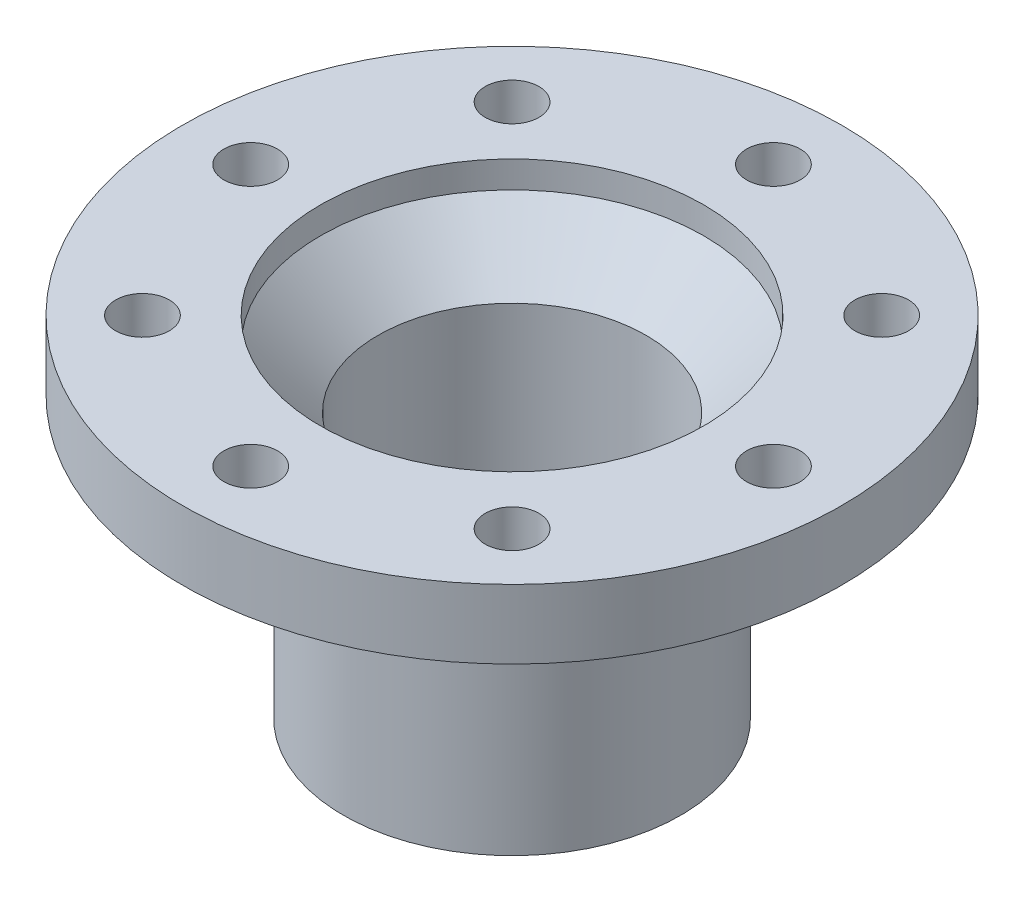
ISO-10303-21;
HEADER;
FILE_DESCRIPTION(('STEP AP214'),'2;1');
FILE_NAME('part.step','',(''),(''),'','','');
FILE_SCHEMA(('AUTOMOTIVE_DESIGN { 1 0 10303 214 1 1 1 1 }'));
ENDSEC;
DATA;
#1=APPLICATION_CONTEXT('core data for automotive mechanical design processes');
#2=APPLICATION_PROTOCOL_DEFINITION('international standard','automotive_design',2000,#1);
#3=PRODUCT_CONTEXT('',#1,'mechanical');
#4=PRODUCT('Part','Part','',(#3));
#5=PRODUCT_RELATED_PRODUCT_CATEGORY('part','',(#4));
#6=PRODUCT_DEFINITION_FORMATION('','',#4);
#7=PRODUCT_DEFINITION_CONTEXT('part definition',#1,'design');
#8=PRODUCT_DEFINITION('design','',#6,#7);
#9=PRODUCT_DEFINITION_SHAPE('','',#8);
#10=(LENGTH_UNIT() NAMED_UNIT(*) SI_UNIT(.MILLI.,.METRE.));
#11=(NAMED_UNIT(*) PLANE_ANGLE_UNIT() SI_UNIT($,.RADIAN.));
#12=(NAMED_UNIT(*) SI_UNIT($,.STERADIAN.) SOLID_ANGLE_UNIT());
#13=UNCERTAINTY_MEASURE_WITH_UNIT(LENGTH_MEASURE(1.E-05),#10,'distance_accuracy_value','');
#14=(GEOMETRIC_REPRESENTATION_CONTEXT(3) GLOBAL_UNCERTAINTY_ASSIGNED_CONTEXT((#13)) GLOBAL_UNIT_ASSIGNED_CONTEXT((#10,
#11,#12)) REPRESENTATION_CONTEXT('',''));
#15=CARTESIAN_POINT('',(0.,0.,0.));
#16=DIRECTION('',(0.,0.,1.));
#17=DIRECTION('',(1.,0.,0.));
#18=AXIS2_PLACEMENT_3D('',#15,#16,#17);
#19=CARTESIAN_POINT('',(0.,30.4825693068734,0.));
#20=DIRECTION('',(0.,1.,0.));
#21=DIRECTION('',(0.,0.,1.));
#22=AXIS2_PLACEMENT_3D('',#19,#20,#21);
#23=CONICAL_SURFACE('',#22,25.,0.78539816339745);
#24=CARTESIAN_POINT('',(0.,22.9825693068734,0.));
#25=DIRECTION('',(0.,-1.,0.));
#26=DIRECTION('',(0.,0.,-1.));
#27=AXIS2_PLACEMENT_3D('',#24,#25,#26);
#28=CIRCLE('',#27,17.5);
#29=CARTESIAN_POINT('',(0.,22.9825693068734,-17.5));
#30=VERTEX_POINT('',#29);
#31=EDGE_CURVE('E10',#30,#30,#28,.T.);
#32=ORIENTED_EDGE('',*,*,#31,.T.);
#33=EDGE_LOOP('',(#32));
#34=FACE_BOUND('',#33,.T.);
#35=CARTESIAN_POINT('',(0.,30.4825693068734,0.));
#36=DIRECTION('',(0.,-1.,0.));
#37=DIRECTION('',(0.,0.,-1.));
#38=AXIS2_PLACEMENT_3D('',#35,#36,#37);
#39=CIRCLE('',#38,25.);
#40=CARTESIAN_POINT('',(0.,30.4825693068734,-25.));
#41=VERTEX_POINT('',#40);
#42=EDGE_CURVE('E60',#41,#41,#39,.T.);
#43=ORIENTED_EDGE('',*,*,#42,.F.);
#44=EDGE_LOOP('',(#43));
#45=FACE_BOUND('',#44,.T.);
#46=ADVANCED_FACE('F29',(#34,#45),#23,.F.);
#47=CARTESIAN_POINT('',(0.,0.,0.));
#48=DIRECTION('',(0.,-1.,0.));
#49=DIRECTION('',(0.,0.,-1.));
#50=AXIS2_PLACEMENT_3D('',#47,#48,#49);
#51=CYLINDRICAL_SURFACE('',#50,17.5);
#52=CARTESIAN_POINT('',(0.,-11.5174306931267,0.));
#53=DIRECTION('',(0.,-1.,0.));
#54=DIRECTION('',(0.,0.,-1.));
#55=AXIS2_PLACEMENT_3D('',#52,#53,#54);
#56=CIRCLE('',#55,17.5);
#57=CARTESIAN_POINT('',(0.,-11.5174306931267,-17.5));
#58=VERTEX_POINT('',#57);
#59=EDGE_CURVE('E35',#58,#58,#56,.T.);
#60=ORIENTED_EDGE('',*,*,#59,.T.);
#61=EDGE_LOOP('',(#60));
#62=FACE_BOUND('',#61,.T.);
#63=ORIENTED_EDGE('',*,*,#31,.F.);
#64=EDGE_LOOP('',(#63));
#65=FACE_BOUND('',#64,.T.);
#66=ADVANCED_FACE('F165',(#62,#65),#51,.F.);
#67=CARTESIAN_POINT('',(17.5,-11.5174306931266,0.));
#68=DIRECTION('',(0.,-1.,0.));
#69=DIRECTION('',(0.,0.,-1.));
#70=AXIS2_PLACEMENT_3D('',#67,#68,#69);
#71=PLANE('',#70);
#72=CARTESIAN_POINT('',(0.,-11.5174306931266,0.));
#73=DIRECTION('',(0.,-1.,0.));
#74=DIRECTION('',(0.,0.,-1.));
#75=AXIS2_PLACEMENT_3D('',#72,#73,#74);
#76=CIRCLE('',#75,22.);
#77=CARTESIAN_POINT('',(0.,-11.5174306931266,-22.));
#78=VERTEX_POINT('',#77);
#79=EDGE_CURVE('E39',#78,#78,#76,.T.);
#80=ORIENTED_EDGE('',*,*,#79,.T.);
#81=EDGE_LOOP('',(#80));
#82=FACE_BOUND('',#81,.T.);
#83=ORIENTED_EDGE('',*,*,#59,.F.);
#84=EDGE_LOOP('',(#83));
#85=FACE_BOUND('',#84,.T.);
#86=ADVANCED_FACE('F159',(#82,#85),#71,.T.);
#87=CARTESIAN_POINT('',(0.,0.,0.));
#88=DIRECTION('',(0.,-1.,0.));
#89=DIRECTION('',(0.,0.,-1.));
#90=AXIS2_PLACEMENT_3D('',#87,#88,#89);
#91=CYLINDRICAL_SURFACE('',#90,22.);
#92=CARTESIAN_POINT('',(0.,21.9825693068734,0.));
#93=DIRECTION('',(0.,-1.,0.));
#94=DIRECTION('',(0.,0.,-1.));
#95=AXIS2_PLACEMENT_3D('',#92,#93,#94);
#96=CIRCLE('',#95,22.);
#97=CARTESIAN_POINT('',(0.,21.9825693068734,-22.));
#98=VERTEX_POINT('',#97);
#99=EDGE_CURVE('E43',#98,#98,#96,.T.);
#100=ORIENTED_EDGE('',*,*,#99,.T.);
#101=EDGE_LOOP('',(#100));
#102=FACE_BOUND('',#101,.T.);
#103=ORIENTED_EDGE('',*,*,#79,.F.);
#104=EDGE_LOOP('',(#103));
#105=FACE_BOUND('',#104,.T.);
#106=ADVANCED_FACE('F153',(#102,#105),#91,.T.);
#107=CARTESIAN_POINT('',(0.,21.9825693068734,0.));
#108=DIRECTION('',(0.,1.,0.));
#109=DIRECTION('',(0.,0.,1.));
#110=AXIS2_PLACEMENT_3D('',#107,#108,#109);
#111=CONICAL_SURFACE('',#110,22.,0.785398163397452);
#112=CARTESIAN_POINT('',(0.,24.9825693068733,0.));
#113=DIRECTION('',(0.,-1.,0.));
#114=DIRECTION('',(0.,0.,-1.));
#115=AXIS2_PLACEMENT_3D('',#112,#113,#114);
#116=CIRCLE('',#115,25.);
#117=CARTESIAN_POINT('',(0.,24.9825693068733,-25.));
#118=VERTEX_POINT('',#117);
#119=EDGE_CURVE('E48',#118,#118,#116,.T.);
#120=ORIENTED_EDGE('',*,*,#119,.T.);
#121=EDGE_LOOP('',(#120));
#122=FACE_BOUND('',#121,.T.);
#123=ORIENTED_EDGE('',*,*,#99,.F.);
#124=EDGE_LOOP('',(#123));
#125=FACE_BOUND('',#124,.T.);
#126=ADVANCED_FACE('F146',(#122,#125),#111,.T.);
#127=CARTESIAN_POINT('',(25.,24.9825693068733,0.));
#128=DIRECTION('',(0.,-1.,0.));
#129=DIRECTION('',(0.,0.,-1.));
#130=AXIS2_PLACEMENT_3D('',#127,#128,#129);
#131=PLANE('',#130);
#132=CARTESIAN_POINT('',(-24.112341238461,24.9825693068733,-24.1123412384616));
#133=DIRECTION('',(0.,-1.,0.));
#134=DIRECTION('',(0.,0.,-1.));
#135=AXIS2_PLACEMENT_3D('',#132,#133,#134);
#136=CIRCLE('',#135,3.5);
#137=CARTESIAN_POINT('',(-24.112341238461,24.9825693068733,-27.6123412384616));
#138=VERTEX_POINT('',#137);
#139=EDGE_CURVE('E105',#138,#138,#136,.T.);
#140=ORIENTED_EDGE('',*,*,#139,.F.);
#141=EDGE_LOOP('',(#140));
#142=FACE_BOUND('',#141,.T.);
#143=CARTESIAN_POINT('',(-34.1,24.9825693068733,-3.53709094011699E-13));
#144=DIRECTION('',(0.,-1.,0.));
#145=DIRECTION('',(0.,0.,-1.));
#146=AXIS2_PLACEMENT_3D('',#143,#144,#145);
#147=CIRCLE('',#146,3.5);
#148=CARTESIAN_POINT('',(-34.1,24.9825693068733,-3.50000000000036));
#149=VERTEX_POINT('',#148);
#150=EDGE_CURVE('E99',#149,#149,#147,.T.);
#151=ORIENTED_EDGE('',*,*,#150,.F.);
#152=EDGE_LOOP('',(#151));
#153=FACE_BOUND('',#152,.T.);
#154=CARTESIAN_POINT('',(-24.1123412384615,24.9825693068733,24.1123412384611));
#155=DIRECTION('',(0.,-1.,0.));
#156=DIRECTION('',(0.,0.,-1.));
#157=AXIS2_PLACEMENT_3D('',#154,#155,#156);
#158=CIRCLE('',#157,3.5);
#159=CARTESIAN_POINT('',(-24.1123412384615,24.9825693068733,20.6123412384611));
#160=VERTEX_POINT('',#159);
#161=EDGE_CURVE('E93',#160,#160,#158,.T.);
#162=ORIENTED_EDGE('',*,*,#161,.F.);
#163=EDGE_LOOP('',(#162));
#164=FACE_BOUND('',#163,.T.);
#165=CARTESIAN_POINT('',(0.,24.9825693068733,34.1));
#166=DIRECTION('',(0.,-1.,0.));
#167=DIRECTION('',(0.,0.,-1.));
#168=AXIS2_PLACEMENT_3D('',#165,#166,#167);
#169=CIRCLE('',#168,3.5);
#170=CARTESIAN_POINT('',(0.,24.9825693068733,30.6));
#171=VERTEX_POINT('',#170);
#172=EDGE_CURVE('E87',#171,#171,#169,.T.);
#173=ORIENTED_EDGE('',*,*,#172,.F.);
#174=EDGE_LOOP('',(#173));
#175=FACE_BOUND('',#174,.T.);
#176=CARTESIAN_POINT('',(24.1123412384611,24.9825693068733,24.1123412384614));
#177=DIRECTION('',(0.,-1.,0.));
#178=DIRECTION('',(0.,0.,-1.));
#179=AXIS2_PLACEMENT_3D('',#176,#177,#178);
#180=CIRCLE('',#179,3.5);
#181=CARTESIAN_POINT('',(24.1123412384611,24.9825693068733,20.6123412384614));
#182=VERTEX_POINT('',#181);
#183=EDGE_CURVE('E81',#182,#182,#180,.T.);
#184=ORIENTED_EDGE('',*,*,#183,.F.);
#185=EDGE_LOOP('',(#184));
#186=FACE_BOUND('',#185,.T.);
#187=CARTESIAN_POINT('',(34.1,24.9825693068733,1.15590066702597E-13));
#188=DIRECTION('',(0.,-1.,0.));
#189=DIRECTION('',(0.,0.,-1.));
#190=AXIS2_PLACEMENT_3D('',#187,#188,#189);
#191=CIRCLE('',#190,3.5);
#192=CARTESIAN_POINT('',(34.1,24.9825693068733,-3.49999999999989));
#193=VERTEX_POINT('',#192);
#194=EDGE_CURVE('E75',#193,#193,#191,.T.);
#195=ORIENTED_EDGE('',*,*,#194,.F.);
#196=EDGE_LOOP('',(#195));
#197=FACE_BOUND('',#196,.T.);
#198=CARTESIAN_POINT('',(24.1123412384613,24.9825693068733,-24.1123412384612));
#199=DIRECTION('',(0.,-1.,0.));
#200=DIRECTION('',(0.,0.,-1.));
#201=AXIS2_PLACEMENT_3D('',#198,#199,#200);
#202=CIRCLE('',#201,3.5);
#203=CARTESIAN_POINT('',(24.1123412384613,24.9825693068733,-27.6123412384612));
#204=VERTEX_POINT('',#203);
#205=EDGE_CURVE('E69',#204,#204,#202,.T.);
#206=ORIENTED_EDGE('',*,*,#205,.F.);
#207=EDGE_LOOP('',(#206));
#208=FACE_BOUND('',#207,.T.);
#209=CARTESIAN_POINT('',(0.,24.9825693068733,-34.1));
#210=DIRECTION('',(0.,-1.,0.));
#211=DIRECTION('',(0.,0.,-1.));
#212=AXIS2_PLACEMENT_3D('',#209,#210,#211);
#213=CIRCLE('',#212,3.5);
#214=CARTESIAN_POINT('',(0.,24.9825693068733,-37.6));
#215=VERTEX_POINT('',#214);
#216=EDGE_CURVE('E63',#215,#215,#213,.T.);
#217=ORIENTED_EDGE('',*,*,#216,.F.);
#218=EDGE_LOOP('',(#217));
#219=FACE_BOUND('',#218,.T.);
#220=CARTESIAN_POINT('',(0.,24.9825693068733,0.));
#221=DIRECTION('',(0.,-1.,0.));
#222=DIRECTION('',(0.,0.,-1.));
#223=AXIS2_PLACEMENT_3D('',#220,#221,#222);
#224=CIRCLE('',#223,43.);
#225=CARTESIAN_POINT('',(0.,24.9825693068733,-43.));
#226=VERTEX_POINT('',#225);
#227=EDGE_CURVE('E51',#226,#226,#224,.T.);
#228=ORIENTED_EDGE('',*,*,#227,.T.);
#229=EDGE_LOOP('',(#228));
#230=FACE_BOUND('',#229,.T.);
#231=ORIENTED_EDGE('',*,*,#119,.F.);
#232=EDGE_LOOP('',(#231));
#233=FACE_BOUND('',#232,.T.);
#234=ADVANCED_FACE('F140',(#142,#153,#164,#175,#186,#197,#208,#219,#230,#233),#131,.T.);
#235=CARTESIAN_POINT('',(0.,0.,0.));
#236=DIRECTION('',(0.,-1.,0.));
#237=DIRECTION('',(0.,0.,-1.));
#238=AXIS2_PLACEMENT_3D('',#235,#236,#237);
#239=CYLINDRICAL_SURFACE('',#238,43.);
#240=CARTESIAN_POINT('',(0.,33.9825693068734,0.));
#241=DIRECTION('',(0.,-1.,0.));
#242=DIRECTION('',(0.,0.,-1.));
#243=AXIS2_PLACEMENT_3D('',#240,#241,#242);
#244=CIRCLE('',#243,43.);
#245=CARTESIAN_POINT('',(0.,33.9825693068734,-43.));
#246=VERTEX_POINT('',#245);
#247=EDGE_CURVE('E54',#246,#246,#244,.T.);
#248=ORIENTED_EDGE('',*,*,#247,.T.);
#249=EDGE_LOOP('',(#248));
#250=FACE_BOUND('',#249,.T.);
#251=ORIENTED_EDGE('',*,*,#227,.F.);
#252=EDGE_LOOP('',(#251));
#253=FACE_BOUND('',#252,.T.);
#254=ADVANCED_FACE('F118',(#250,#253),#239,.T.);
#255=CARTESIAN_POINT('',(43.,33.9825693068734,0.));
#256=DIRECTION('',(0.,1.,0.));
#257=DIRECTION('',(0.,0.,1.));
#258=AXIS2_PLACEMENT_3D('',#255,#256,#257);
#259=PLANE('',#258);
#260=CARTESIAN_POINT('',(-24.112341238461,33.9825693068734,-24.1123412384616));
#261=DIRECTION('',(0.,1.,0.));
#262=DIRECTION('',(0.707106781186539,0.,0.707106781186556));
#263=AXIS2_PLACEMENT_3D('',#260,#261,#262);
#264=CIRCLE('',#263,3.5);
#265=CARTESIAN_POINT('',(-21.6374675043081,33.9825693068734,-21.6374675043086));
#266=VERTEX_POINT('',#265);
#267=EDGE_CURVE('E108',#266,#266,#264,.T.);
#268=ORIENTED_EDGE('',*,*,#267,.F.);
#269=EDGE_LOOP('',(#268));
#270=FACE_BOUND('',#269,.T.);
#271=CARTESIAN_POINT('',(-34.1,33.9825693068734,-3.53709094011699E-13));
#272=DIRECTION('',(0.,1.,0.));
#273=DIRECTION('',(1.,0.,0.));
#274=AXIS2_PLACEMENT_3D('',#271,#272,#273);
#275=CIRCLE('',#274,3.5);
#276=CARTESIAN_POINT('',(-30.6,33.9825693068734,-3.17048539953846E-13));
#277=VERTEX_POINT('',#276);
#278=EDGE_CURVE('E102',#277,#277,#275,.T.);
#279=ORIENTED_EDGE('',*,*,#278,.F.);
#280=EDGE_LOOP('',(#279));
#281=FACE_BOUND('',#280,.T.);
#282=CARTESIAN_POINT('',(-24.1123412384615,33.9825693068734,24.1123412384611));
#283=DIRECTION('',(0.,1.,0.));
#284=DIRECTION('',(0.707106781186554,0.,-0.707106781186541));
#285=AXIS2_PLACEMENT_3D('',#282,#283,#284);
#286=CIRCLE('',#285,3.5);
#287=CARTESIAN_POINT('',(-21.6374675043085,33.9825693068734,21.6374675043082));
#288=VERTEX_POINT('',#287);
#289=EDGE_CURVE('E96',#288,#288,#286,.T.);
#290=ORIENTED_EDGE('',*,*,#289,.F.);
#291=EDGE_LOOP('',(#290));
#292=FACE_BOUND('',#291,.T.);
#293=CARTESIAN_POINT('',(0.,33.9825693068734,34.1));
#294=DIRECTION('',(0.,1.,0.));
#295=DIRECTION('',(0.,0.,-1.));
#296=AXIS2_PLACEMENT_3D('',#293,#294,#295);
#297=CIRCLE('',#296,3.5);
#298=CARTESIAN_POINT('',(0.,33.9825693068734,30.6));
#299=VERTEX_POINT('',#298);
#300=EDGE_CURVE('E90',#299,#299,#297,.T.);
#301=ORIENTED_EDGE('',*,*,#300,.F.);
#302=EDGE_LOOP('',(#301));
#303=FACE_BOUND('',#302,.T.);
#304=CARTESIAN_POINT('',(24.1123412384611,33.9825693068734,24.1123412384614));
#305=DIRECTION('',(0.,1.,0.));
#306=DIRECTION('',(-0.707106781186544,0.,-0.707106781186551));
#307=AXIS2_PLACEMENT_3D('',#304,#305,#306);
#308=CIRCLE('',#307,3.5);
#309=CARTESIAN_POINT('',(21.6374675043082,33.9825693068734,21.6374675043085));
#310=VERTEX_POINT('',#309);
#311=EDGE_CURVE('E84',#310,#310,#308,.T.);
#312=ORIENTED_EDGE('',*,*,#311,.F.);
#313=EDGE_LOOP('',(#312));
#314=FACE_BOUND('',#313,.T.);
#315=CARTESIAN_POINT('',(34.1,33.9825693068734,1.15590066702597E-13));
#316=DIRECTION('',(0.,1.,0.));
#317=DIRECTION('',(-1.,0.,0.));
#318=AXIS2_PLACEMENT_3D('',#315,#316,#317);
#319=CIRCLE('',#318,3.5);
#320=CARTESIAN_POINT('',(30.6,33.9825693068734,1.03369882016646E-13));
#321=VERTEX_POINT('',#320);
#322=EDGE_CURVE('E78',#321,#321,#319,.T.);
#323=ORIENTED_EDGE('',*,*,#322,.F.);
#324=EDGE_LOOP('',(#323));
#325=FACE_BOUND('',#324,.T.);
#326=CARTESIAN_POINT('',(24.1123412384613,33.9825693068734,-24.1123412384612));
#327=DIRECTION('',(0.,1.,0.));
#328=DIRECTION('',(-0.707106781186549,0.,0.707106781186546));
#329=AXIS2_PLACEMENT_3D('',#326,#327,#328);
#330=CIRCLE('',#329,3.5);
#331=CARTESIAN_POINT('',(21.6374675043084,33.9825693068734,-21.6374675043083));
#332=VERTEX_POINT('',#331);
#333=EDGE_CURVE('E72',#332,#332,#330,.T.);
#334=ORIENTED_EDGE('',*,*,#333,.F.);
#335=EDGE_LOOP('',(#334));
#336=FACE_BOUND('',#335,.T.);
#337=CARTESIAN_POINT('',(0.,33.9825693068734,-34.1));
#338=DIRECTION('',(0.,1.,0.));
#339=DIRECTION('',(0.,0.,1.));
#340=AXIS2_PLACEMENT_3D('',#337,#338,#339);
#341=CIRCLE('',#340,3.5);
#342=CARTESIAN_POINT('',(0.,33.9825693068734,-30.6));
#343=VERTEX_POINT('',#342);
#344=EDGE_CURVE('E66',#343,#343,#341,.T.);
#345=ORIENTED_EDGE('',*,*,#344,.F.);
#346=EDGE_LOOP('',(#345));
#347=FACE_BOUND('',#346,.T.);
#348=CARTESIAN_POINT('',(0.,33.9825693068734,0.));
#349=DIRECTION('',(0.,-1.,0.));
#350=DIRECTION('',(0.,0.,-1.));
#351=AXIS2_PLACEMENT_3D('',#348,#349,#350);
#352=CIRCLE('',#351,25.);
#353=CARTESIAN_POINT('',(0.,33.9825693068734,-25.));
#354=VERTEX_POINT('',#353);
#355=EDGE_CURVE('E57',#354,#354,#352,.T.);
#356=ORIENTED_EDGE('',*,*,#355,.T.);
#357=EDGE_LOOP('',(#356));
#358=FACE_BOUND('',#357,.T.);
#359=ORIENTED_EDGE('',*,*,#247,.F.);
#360=EDGE_LOOP('',(#359));
#361=FACE_BOUND('',#360,.T.);
#362=ADVANCED_FACE('F114',(#270,#281,#292,#303,#314,#325,#336,#347,#358,#361),#259,.T.);
#363=CARTESIAN_POINT('',(0.,0.,0.));
#364=DIRECTION('',(0.,-1.,0.));
#365=DIRECTION('',(0.,0.,-1.));
#366=AXIS2_PLACEMENT_3D('',#363,#364,#365);
#367=CYLINDRICAL_SURFACE('',#366,25.);
#368=ORIENTED_EDGE('',*,*,#42,.T.);
#369=EDGE_LOOP('',(#368));
#370=FACE_BOUND('',#369,.T.);
#371=ORIENTED_EDGE('',*,*,#355,.F.);
#372=EDGE_LOOP('',(#371));
#373=FACE_BOUND('',#372,.T.);
#374=ADVANCED_FACE('F117',(#370,#373),#367,.F.);
#375=CARTESIAN_POINT('',(0.,23.9825693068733,-34.1));
#376=DIRECTION('',(0.,1.,0.));
#377=DIRECTION('',(0.,0.,1.));
#378=AXIS2_PLACEMENT_3D('',#375,#376,#377);
#379=CYLINDRICAL_SURFACE('',#378,3.5);
#380=ORIENTED_EDGE('',*,*,#216,.T.);
#381=EDGE_LOOP('',(#380));
#382=FACE_BOUND('',#381,.T.);
#383=ORIENTED_EDGE('',*,*,#344,.T.);
#384=EDGE_LOOP('',(#383));
#385=FACE_BOUND('',#384,.T.);
#386=ADVANCED_FACE('F178',(#382,#385),#379,.F.);
#387=CARTESIAN_POINT('',(24.1123412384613,23.9825693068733,-24.1123412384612));
#388=DIRECTION('',(0.,1.,0.));
#389=DIRECTION('',(0.,0.,1.));
#390=AXIS2_PLACEMENT_3D('',#387,#388,#389);
#391=CYLINDRICAL_SURFACE('',#390,3.5);
#392=ORIENTED_EDGE('',*,*,#205,.T.);
#393=EDGE_LOOP('',(#392));
#394=FACE_BOUND('',#393,.T.);
#395=ORIENTED_EDGE('',*,*,#333,.T.);
#396=EDGE_LOOP('',(#395));
#397=FACE_BOUND('',#396,.T.);
#398=ADVANCED_FACE('F183',(#394,#397),#391,.F.);
#399=CARTESIAN_POINT('',(34.1,23.9825693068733,1.15590066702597E-13));
#400=DIRECTION('',(0.,1.,0.));
#401=DIRECTION('',(0.,0.,1.));
#402=AXIS2_PLACEMENT_3D('',#399,#400,#401);
#403=CYLINDRICAL_SURFACE('',#402,3.5);
#404=ORIENTED_EDGE('',*,*,#194,.T.);
#405=EDGE_LOOP('',(#404));
#406=FACE_BOUND('',#405,.T.);
#407=ORIENTED_EDGE('',*,*,#322,.T.);
#408=EDGE_LOOP('',(#407));
#409=FACE_BOUND('',#408,.T.);
#410=ADVANCED_FACE('F189',(#406,#409),#403,.F.);
#411=CARTESIAN_POINT('',(24.1123412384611,23.9825693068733,24.1123412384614));
#412=DIRECTION('',(0.,1.,0.));
#413=DIRECTION('',(0.,0.,1.));
#414=AXIS2_PLACEMENT_3D('',#411,#412,#413);
#415=CYLINDRICAL_SURFACE('',#414,3.5);
#416=ORIENTED_EDGE('',*,*,#183,.T.);
#417=EDGE_LOOP('',(#416));
#418=FACE_BOUND('',#417,.T.);
#419=ORIENTED_EDGE('',*,*,#311,.T.);
#420=EDGE_LOOP('',(#419));
#421=FACE_BOUND('',#420,.T.);
#422=ADVANCED_FACE('F193',(#418,#421),#415,.F.);
#423=CARTESIAN_POINT('',(0.,23.9825693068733,34.1));
#424=DIRECTION('',(0.,1.,0.));
#425=DIRECTION('',(0.,0.,1.));
#426=AXIS2_PLACEMENT_3D('',#423,#424,#425);
#427=CYLINDRICAL_SURFACE('',#426,3.5);
#428=ORIENTED_EDGE('',*,*,#172,.T.);
#429=EDGE_LOOP('',(#428));
#430=FACE_BOUND('',#429,.T.);
#431=ORIENTED_EDGE('',*,*,#300,.T.);
#432=EDGE_LOOP('',(#431));
#433=FACE_BOUND('',#432,.T.);
#434=ADVANCED_FACE('F197',(#430,#433),#427,.F.);
#435=CARTESIAN_POINT('',(-24.1123412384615,23.9825693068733,24.1123412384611));
#436=DIRECTION('',(0.,1.,0.));
#437=DIRECTION('',(0.,0.,1.));
#438=AXIS2_PLACEMENT_3D('',#435,#436,#437);
#439=CYLINDRICAL_SURFACE('',#438,3.5);
#440=ORIENTED_EDGE('',*,*,#161,.T.);
#441=EDGE_LOOP('',(#440));
#442=FACE_BOUND('',#441,.T.);
#443=ORIENTED_EDGE('',*,*,#289,.T.);
#444=EDGE_LOOP('',(#443));
#445=FACE_BOUND('',#444,.T.);
#446=ADVANCED_FACE('F201',(#442,#445),#439,.F.);
#447=CARTESIAN_POINT('',(-34.1,23.9825693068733,-3.53709094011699E-13));
#448=DIRECTION('',(0.,1.,0.));
#449=DIRECTION('',(0.,0.,1.));
#450=AXIS2_PLACEMENT_3D('',#447,#448,#449);
#451=CYLINDRICAL_SURFACE('',#450,3.5);
#452=ORIENTED_EDGE('',*,*,#150,.T.);
#453=EDGE_LOOP('',(#452));
#454=FACE_BOUND('',#453,.T.);
#455=ORIENTED_EDGE('',*,*,#278,.T.);
#456=EDGE_LOOP('',(#455));
#457=FACE_BOUND('',#456,.T.);
#458=ADVANCED_FACE('F205',(#454,#457),#451,.F.);
#459=CARTESIAN_POINT('',(-24.112341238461,23.9825693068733,-24.1123412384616));
#460=DIRECTION('',(0.,1.,0.));
#461=DIRECTION('',(0.,0.,1.));
#462=AXIS2_PLACEMENT_3D('',#459,#460,#461);
#463=CYLINDRICAL_SURFACE('',#462,3.5);
#464=ORIENTED_EDGE('',*,*,#139,.T.);
#465=EDGE_LOOP('',(#464));
#466=FACE_BOUND('',#465,.T.);
#467=ORIENTED_EDGE('',*,*,#267,.T.);
#468=EDGE_LOOP('',(#467));
#469=FACE_BOUND('',#468,.T.);
#470=ADVANCED_FACE('F112',(#466,#469),#463,.F.);
#471=CLOSED_SHELL('',(#46,#66,#86,#106,#126,#234,#254,#362,#374,#386,#398,#410,#422,#434,#446,
#458,#470));
#472=MANIFOLD_SOLID_BREP('B2',#471);
#473=ADVANCED_BREP_SHAPE_REPRESENTATION('',(#18,#472),#14);
#474=SHAPE_DEFINITION_REPRESENTATION(#9,#473);
ENDSEC;
END-ISO-10303-21;
